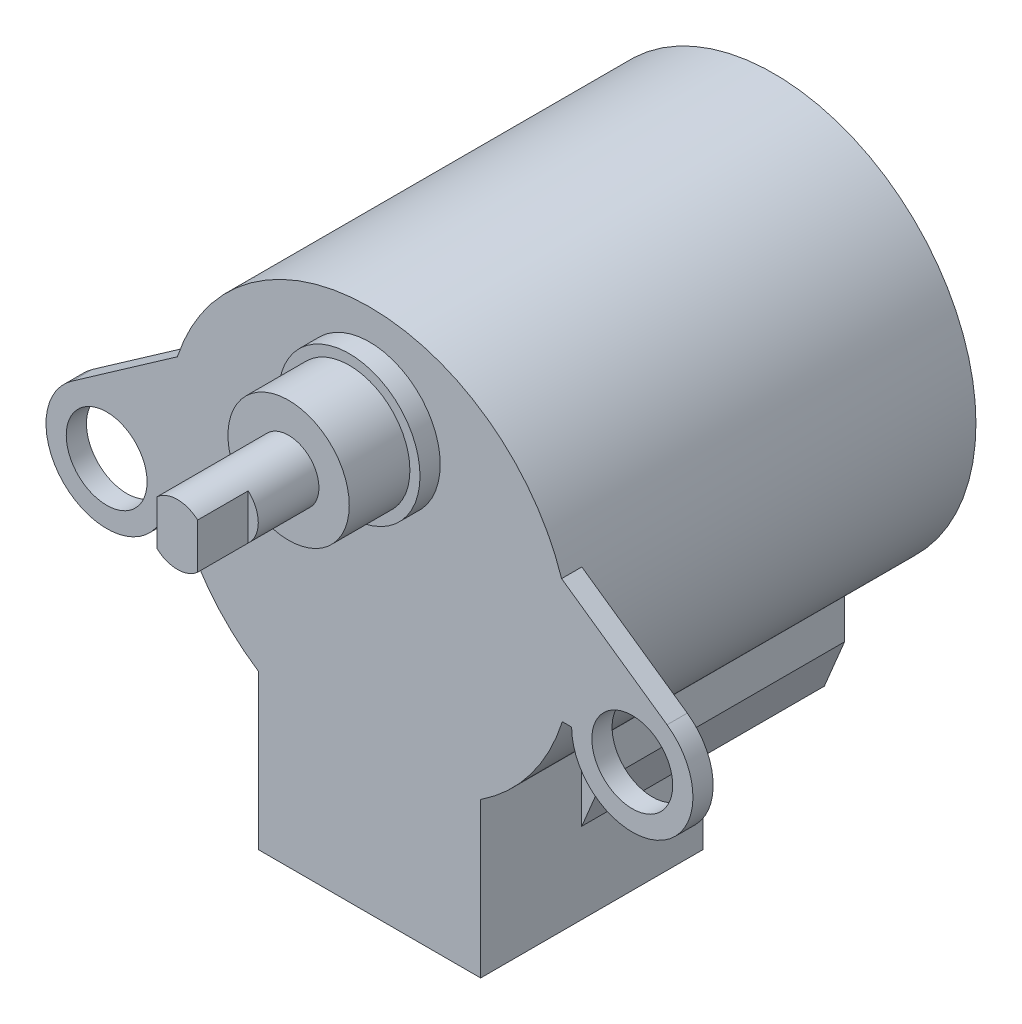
ISO-10303-21;
HEADER;
FILE_DESCRIPTION(('STEP AP214'),'2;1');
FILE_NAME('part.step','',(''),(''),'','','');
FILE_SCHEMA(('AUTOMOTIVE_DESIGN { 1 0 10303 214 1 1 1 1 }'));
ENDSEC;
DATA;
#1=APPLICATION_CONTEXT('core data for automotive mechanical design processes');
#2=APPLICATION_PROTOCOL_DEFINITION('international standard','automotive_design',2000,#1);
#3=PRODUCT_CONTEXT('',#1,'mechanical');
#4=PRODUCT('Part','Part','',(#3));
#5=PRODUCT_RELATED_PRODUCT_CATEGORY('part','',(#4));
#6=PRODUCT_DEFINITION_FORMATION('','',#4);
#7=PRODUCT_DEFINITION_CONTEXT('part definition',#1,'design');
#8=PRODUCT_DEFINITION('design','',#6,#7);
#9=PRODUCT_DEFINITION_SHAPE('','',#8);
#10=(LENGTH_UNIT() NAMED_UNIT(*) SI_UNIT(.MILLI.,.METRE.));
#11=(NAMED_UNIT(*) PLANE_ANGLE_UNIT() SI_UNIT($,.RADIAN.));
#12=(NAMED_UNIT(*) SI_UNIT($,.STERADIAN.) SOLID_ANGLE_UNIT());
#13=UNCERTAINTY_MEASURE_WITH_UNIT(LENGTH_MEASURE(1.E-05),#10,'distance_accuracy_value','');
#14=(GEOMETRIC_REPRESENTATION_CONTEXT(3) GLOBAL_UNCERTAINTY_ASSIGNED_CONTEXT((#13)) GLOBAL_UNIT_ASSIGNED_CONTEXT((#10,
#11,#12)) REPRESENTATION_CONTEXT('',''));
#15=CARTESIAN_POINT('',(0.,0.,0.));
#16=DIRECTION('',(0.,0.,1.));
#17=DIRECTION('',(1.,0.,0.));
#18=AXIS2_PLACEMENT_3D('',#15,#16,#17);
#19=CARTESIAN_POINT('',(0.,5.,4.));
#20=DIRECTION('',(0.,0.,1.));
#21=DIRECTION('',(1.,0.,0.));
#22=AXIS2_PLACEMENT_3D('',#19,#20,#21);
#23=PLANE('',#22);
#24=CARTESIAN_POINT('',(0.,5.,4.));
#25=DIRECTION('',(0.,0.,1.));
#26=DIRECTION('',(1.,0.,0.));
#27=AXIS2_PLACEMENT_3D('',#24,#25,#26);
#28=CIRCLE('',#27,3.);
#29=CARTESIAN_POINT('',(3.,5.,4.));
#30=VERTEX_POINT('',#29);
#31=EDGE_CURVE('E209',#30,#30,#28,.T.);
#32=ORIENTED_EDGE('',*,*,#31,.T.);
#33=EDGE_LOOP('',(#32));
#34=FACE_BOUND('',#33,.T.);
#35=CARTESIAN_POINT('',(0.,5.,4.));
#36=DIRECTION('',(0.,0.,1.));
#37=DIRECTION('',(1.,0.,0.));
#38=AXIS2_PLACEMENT_3D('',#35,#36,#37);
#39=CIRCLE('',#38,1.5);
#40=CARTESIAN_POINT('',(1.5,5.,4.));
#41=VERTEX_POINT('',#40);
#42=EDGE_CURVE('E211',#41,#41,#39,.T.);
#43=ORIENTED_EDGE('',*,*,#42,.F.);
#44=EDGE_LOOP('',(#43));
#45=FACE_BOUND('',#44,.T.);
#46=ADVANCED_FACE('F31',(#34,#45),#23,.T.);
#47=CARTESIAN_POINT('',(0.,5.,1.));
#48=DIRECTION('',(0.,0.,1.));
#49=DIRECTION('',(1.,0.,0.));
#50=AXIS2_PLACEMENT_3D('',#47,#48,#49);
#51=PLANE('',#50);
#52=CARTESIAN_POINT('',(0.,5.,1.));
#53=DIRECTION('',(0.,0.,1.));
#54=DIRECTION('',(1.,0.,0.));
#55=AXIS2_PLACEMENT_3D('',#52,#53,#54);
#56=CIRCLE('',#55,3.5);
#57=CARTESIAN_POINT('',(3.5,5.,1.));
#58=VERTEX_POINT('',#57);
#59=EDGE_CURVE('E220',#58,#58,#56,.T.);
#60=ORIENTED_EDGE('',*,*,#59,.T.);
#61=EDGE_LOOP('',(#60));
#62=FACE_BOUND('',#61,.T.);
#63=CARTESIAN_POINT('',(0.,5.,1.));
#64=DIRECTION('',(0.,0.,1.));
#65=DIRECTION('',(1.,0.,0.));
#66=AXIS2_PLACEMENT_3D('',#63,#64,#65);
#67=CIRCLE('',#66,3.);
#68=CARTESIAN_POINT('',(3.,5.,1.));
#69=VERTEX_POINT('',#68);
#70=EDGE_CURVE('E205',#69,#69,#67,.T.);
#71=ORIENTED_EDGE('',*,*,#70,.F.);
#72=EDGE_LOOP('',(#71));
#73=FACE_BOUND('',#72,.T.);
#74=ADVANCED_FACE('F483',(#62,#73),#51,.T.);
#75=CARTESIAN_POINT('',(0.,0.,0.));
#76=DIRECTION('',(0.,0.,1.));
#77=DIRECTION('',(1.,0.,0.));
#78=AXIS2_PLACEMENT_3D('',#75,#76,#77);
#79=PLANE('',#78);
#80=CARTESIAN_POINT('',(-13.,-3.,0.));
#81=DIRECTION('',(0.,0.,-1.));
#82=DIRECTION('',(-1.,0.,0.));
#83=AXIS2_PLACEMENT_3D('',#80,#81,#82);
#84=CIRCLE('',#83,2.);
#85=CARTESIAN_POINT('',(-15.,-3.,0.));
#86=VERTEX_POINT('',#85);
#87=EDGE_CURVE('E224',#86,#86,#84,.T.);
#88=ORIENTED_EDGE('',*,*,#87,.T.);
#89=EDGE_LOOP('',(#88));
#90=FACE_BOUND('',#89,.T.);
#91=CARTESIAN_POINT('',(13.,-3.,0.));
#92=DIRECTION('',(0.,0.,1.));
#93=DIRECTION('',(1.,0.,0.));
#94=AXIS2_PLACEMENT_3D('',#91,#92,#93);
#95=CIRCLE('',#94,2.);
#96=CARTESIAN_POINT('',(15.,-3.,0.));
#97=VERTEX_POINT('',#96);
#98=EDGE_CURVE('E249',#97,#97,#95,.T.);
#99=ORIENTED_EDGE('',*,*,#98,.F.);
#100=EDGE_LOOP('',(#99));
#101=FACE_BOUND('',#100,.T.);
#102=CARTESIAN_POINT('',(0.,0.,0.));
#103=DIRECTION('',(0.,0.,1.));
#104=DIRECTION('',(1.,0.,0.));
#105=AXIS2_PLACEMENT_3D('',#102,#103,#104);
#106=CIRCLE('',#105,10.);
#107=CARTESIAN_POINT('',(5.5,-8.35164654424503,0.));
#108=VERTEX_POINT('',#107);
#109=CARTESIAN_POINT('',(9.53939201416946,-3.,0.));
#110=VERTEX_POINT('',#109);
#111=EDGE_CURVE('E372',#108,#110,#106,.T.);
#112=ORIENTED_EDGE('',*,*,#111,.T.);
#113=DIRECTION('',(1.,0.,0.));
#114=VECTOR('',#113,1.);
#115=CARTESIAN_POINT('',(10.,-3.,0.));
#116=LINE('',#115,#114);
#117=CARTESIAN_POINT('',(10.,-3.,0.));
#118=VERTEX_POINT('',#117);
#119=EDGE_CURVE('E268',#110,#118,#116,.T.);
#120=ORIENTED_EDGE('',*,*,#119,.T.);
#121=CARTESIAN_POINT('',(13.,-3.,0.));
#122=DIRECTION('',(0.,0.,1.));
#123=DIRECTION('',(1.,0.,0.));
#124=AXIS2_PLACEMENT_3D('',#121,#122,#123);
#125=CIRCLE('',#124,3.);
#126=CARTESIAN_POINT('',(14.7207293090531,-0.542543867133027,0.));
#127=VERTEX_POINT('',#126);
#128=EDGE_CURVE('E263',#118,#127,#125,.T.);
#129=ORIENTED_EDGE('',*,*,#128,.T.);
#130=DIRECTION('',(-0.819152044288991,0.573576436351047,0.));
#131=VECTOR('',#130,1.);
#132=CARTESIAN_POINT('',(14.7207293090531,-0.542543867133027,0.));
#133=LINE('',#132,#131);
#134=CARTESIAN_POINT('',(9.50402273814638,3.11023339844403,0.));
#135=VERTEX_POINT('',#134);
#136=EDGE_CURVE('E266',#127,#135,#133,.T.);
#137=ORIENTED_EDGE('',*,*,#136,.T.);
#138=CARTESIAN_POINT('',(-9.50402273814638,3.11023339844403,0.));
#139=VERTEX_POINT('',#138);
#140=EDGE_CURVE('E376',#135,#139,#106,.T.);
#141=ORIENTED_EDGE('',*,*,#140,.T.);
#142=DIRECTION('',(0.819152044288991,0.573576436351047,0.));
#143=VECTOR('',#142,1.);
#144=CARTESIAN_POINT('',(-14.7207293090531,-0.542543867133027,0.));
#145=LINE('',#144,#143);
#146=CARTESIAN_POINT('',(-14.7207293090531,-0.542543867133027,0.));
#147=VERTEX_POINT('',#146);
#148=EDGE_CURVE('E234',#147,#139,#145,.T.);
#149=ORIENTED_EDGE('',*,*,#148,.F.);
#150=CARTESIAN_POINT('',(-13.,-3.,0.));
#151=DIRECTION('',(0.,0.,-1.));
#152=DIRECTION('',(-1.,0.,0.));
#153=AXIS2_PLACEMENT_3D('',#150,#151,#152);
#154=CIRCLE('',#153,3.);
#155=CARTESIAN_POINT('',(-10.,-3.,0.));
#156=VERTEX_POINT('',#155);
#157=EDGE_CURVE('E227',#156,#147,#154,.T.);
#158=ORIENTED_EDGE('',*,*,#157,.F.);
#159=DIRECTION('',(-1.,0.,0.));
#160=VECTOR('',#159,1.);
#161=CARTESIAN_POINT('',(-10.,-3.,0.));
#162=LINE('',#161,#160);
#163=CARTESIAN_POINT('',(-9.53939201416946,-3.,0.));
#164=VERTEX_POINT('',#163);
#165=EDGE_CURVE('E232',#164,#156,#162,.T.);
#166=ORIENTED_EDGE('',*,*,#165,.F.);
#167=CARTESIAN_POINT('',(-5.5,-8.35164654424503,0.));
#168=VERTEX_POINT('',#167);
#169=EDGE_CURVE('E365',#164,#168,#106,.T.);
#170=ORIENTED_EDGE('',*,*,#169,.T.);
#171=DIRECTION('',(0.,-1.,0.));
#172=VECTOR('',#171,1.);
#173=CARTESIAN_POINT('',(-5.5,-8.35164654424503,0.));
#174=LINE('',#173,#172);
#175=CARTESIAN_POINT('',(-5.5,-16.,0.));
#176=VERTEX_POINT('',#175);
#177=EDGE_CURVE('E348',#168,#176,#174,.T.);
#178=ORIENTED_EDGE('',*,*,#177,.T.);
#179=DIRECTION('',(1.,0.,0.));
#180=VECTOR('',#179,1.);
#181=CARTESIAN_POINT('',(-5.5,-16.,0.));
#182=LINE('',#181,#180);
#183=CARTESIAN_POINT('',(5.5,-16.,0.));
#184=VERTEX_POINT('',#183);
#185=EDGE_CURVE('E351',#176,#184,#182,.T.);
#186=ORIENTED_EDGE('',*,*,#185,.T.);
#187=DIRECTION('',(0.,1.,0.));
#188=VECTOR('',#187,1.);
#189=CARTESIAN_POINT('',(5.5,-8.35164654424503,0.));
#190=LINE('',#189,#188);
#191=EDGE_CURVE('E345',#184,#108,#190,.T.);
#192=ORIENTED_EDGE('',*,*,#191,.T.);
#193=EDGE_LOOP('',(#112,#120,#129,#137,#141,#149,#158,#166,#170,#178,#186,#192));
#194=FACE_BOUND('',#193,.T.);
#195=CARTESIAN_POINT('',(0.,5.,0.));
#196=DIRECTION('',(0.,0.,1.));
#197=DIRECTION('',(1.,0.,0.));
#198=AXIS2_PLACEMENT_3D('',#195,#196,#197);
#199=CIRCLE('',#198,3.5);
#200=CARTESIAN_POINT('',(3.5,5.,0.));
#201=VERTEX_POINT('',#200);
#202=EDGE_CURVE('E217',#201,#201,#199,.T.);
#203=ORIENTED_EDGE('',*,*,#202,.F.);
#204=EDGE_LOOP('',(#203));
#205=FACE_BOUND('',#204,.T.);
#206=ADVANCED_FACE('F400',(#90,#101,#194,#205),#79,.T.);
#207=CARTESIAN_POINT('',(-13.,-3.,-1.));
#208=DIRECTION('',(0.,0.,1.));
#209=DIRECTION('',(-1.,0.,0.));
#210=AXIS2_PLACEMENT_3D('',#207,#208,#209);
#211=PLANE('',#210);
#212=CARTESIAN_POINT('',(-13.,-3.,-1.));
#213=DIRECTION('',(0.,0.,-1.));
#214=DIRECTION('',(-1.,0.,0.));
#215=AXIS2_PLACEMENT_3D('',#212,#213,#214);
#216=CIRCLE('',#215,3.);
#217=CARTESIAN_POINT('',(-10.,-3.,-1.));
#218=VERTEX_POINT('',#217);
#219=CARTESIAN_POINT('',(-14.7207293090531,-0.542543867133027,-1.));
#220=VERTEX_POINT('',#219);
#221=EDGE_CURVE('E236',#218,#220,#216,.T.);
#222=ORIENTED_EDGE('',*,*,#221,.T.);
#223=DIRECTION('',(0.819152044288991,0.573576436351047,0.));
#224=VECTOR('',#223,1.);
#225=CARTESIAN_POINT('',(-14.7207293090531,-0.542543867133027,-1.));
#226=LINE('',#225,#224);
#227=CARTESIAN_POINT('',(-9.50402273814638,3.11023339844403,-1.));
#228=VERTEX_POINT('',#227);
#229=EDGE_CURVE('E243',#220,#228,#226,.T.);
#230=ORIENTED_EDGE('',*,*,#229,.T.);
#231=CARTESIAN_POINT('',(0.,0.,-1.));
#232=DIRECTION('',(0.,0.,1.));
#233=DIRECTION('',(-1.,0.,0.));
#234=AXIS2_PLACEMENT_3D('',#231,#232,#233);
#235=CIRCLE('',#234,10.);
#236=CARTESIAN_POINT('',(-9.53939201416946,-3.,-1.));
#237=VERTEX_POINT('',#236);
#238=EDGE_CURVE('E241',#228,#237,#235,.T.);
#239=ORIENTED_EDGE('',*,*,#238,.T.);
#240=DIRECTION('',(-1.,0.,0.));
#241=VECTOR('',#240,1.);
#242=CARTESIAN_POINT('',(-10.,-3.,-1.));
#243=LINE('',#242,#241);
#244=EDGE_CURVE('E239',#237,#218,#243,.T.);
#245=ORIENTED_EDGE('',*,*,#244,.T.);
#246=EDGE_LOOP('',(#222,#230,#239,#245));
#247=FACE_BOUND('',#246,.T.);
#248=CARTESIAN_POINT('',(-13.,-3.,-1.));
#249=DIRECTION('',(0.,0.,1.));
#250=DIRECTION('',(1.,0.,0.));
#251=AXIS2_PLACEMENT_3D('',#248,#249,#250);
#252=CIRCLE('',#251,2.);
#253=CARTESIAN_POINT('',(-11.,-3.,-1.));
#254=VERTEX_POINT('',#253);
#255=EDGE_CURVE('E223',#254,#254,#252,.T.);
#256=ORIENTED_EDGE('',*,*,#255,.T.);
#257=EDGE_LOOP('',(#256));
#258=FACE_BOUND('',#257,.T.);
#259=ADVANCED_FACE('F462',(#247,#258),#211,.F.);
#260=CARTESIAN_POINT('',(0.,0.,-20.));
#261=DIRECTION('',(0.,0.,1.));
#262=DIRECTION('',(1.,0.,0.));
#263=AXIS2_PLACEMENT_3D('',#260,#261,#262);
#264=CYLINDRICAL_SURFACE('',#263,10.);
#265=CARTESIAN_POINT('',(0.,0.,-20.));
#266=DIRECTION('',(0.,0.,1.));
#267=DIRECTION('',(1.,0.,0.));
#268=AXIS2_PLACEMENT_3D('',#265,#266,#267);
#269=CIRCLE('',#268,10.);
#270=CARTESIAN_POINT('',(10.,0.,-20.));
#271=VERTEX_POINT('',#270);
#272=EDGE_CURVE('E375',#271,#271,#269,.T.);
#273=ORIENTED_EDGE('',*,*,#272,.T.);
#274=EDGE_LOOP('',(#273));
#275=FACE_BOUND('',#274,.T.);
#276=ORIENTED_EDGE('',*,*,#238,.F.);
#277=DIRECTION('',(0.,0.,1.));
#278=VECTOR('',#277,1.);
#279=CARTESIAN_POINT('',(-9.50402273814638,3.11023339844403,-1.));
#280=LINE('',#279,#278);
#281=EDGE_CURVE('E250',#228,#139,#280,.T.);
#282=ORIENTED_EDGE('',*,*,#281,.T.);
#283=ORIENTED_EDGE('',*,*,#140,.F.);
#284=DIRECTION('',(0.,0.,1.));
#285=VECTOR('',#284,1.);
#286=CARTESIAN_POINT('',(9.50402273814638,3.11023339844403,-1.));
#287=LINE('',#286,#285);
#288=CARTESIAN_POINT('',(9.50402273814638,3.11023339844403,-1.));
#289=VERTEX_POINT('',#288);
#290=EDGE_CURVE('E290',#289,#135,#287,.T.);
#291=ORIENTED_EDGE('',*,*,#290,.F.);
#292=CARTESIAN_POINT('',(0.,0.,-1.));
#293=DIRECTION('',(0.,0.,-1.));
#294=DIRECTION('',(1.,0.,0.));
#295=AXIS2_PLACEMENT_3D('',#292,#293,#294);
#296=CIRCLE('',#295,10.);
#297=CARTESIAN_POINT('',(9.53939201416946,-3.,-1.));
#298=VERTEX_POINT('',#297);
#299=EDGE_CURVE('E277',#289,#298,#296,.T.);
#300=ORIENTED_EDGE('',*,*,#299,.T.);
#301=DIRECTION('',(0.,0.,1.));
#302=VECTOR('',#301,1.);
#303=CARTESIAN_POINT('',(9.53939201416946,-3.,-1.));
#304=LINE('',#303,#302);
#305=EDGE_CURVE('E287',#298,#110,#304,.T.);
#306=ORIENTED_EDGE('',*,*,#305,.T.);
#307=ORIENTED_EDGE('',*,*,#111,.F.);
#308=DIRECTION('',(0.,0.,1.));
#309=VECTOR('',#308,1.);
#310=CARTESIAN_POINT('',(5.5,-8.35164654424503,-11.));
#311=LINE('',#310,#309);
#312=CARTESIAN_POINT('',(5.5,-8.35164654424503,-5.));
#313=VERTEX_POINT('',#312);
#314=EDGE_CURVE('E362',#313,#108,#311,.T.);
#315=ORIENTED_EDGE('',*,*,#314,.F.);
#316=CARTESIAN_POINT('',(0.,0.,-5.));
#317=DIRECTION('',(0.,0.,1.));
#318=DIRECTION('',(-1.,0.,0.));
#319=AXIS2_PLACEMENT_3D('',#316,#317,#318);
#320=CIRCLE('',#319,10.);
#321=CARTESIAN_POINT('',(6.5,-7.59934207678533,-5.));
#322=VERTEX_POINT('',#321);
#323=EDGE_CURVE('E322',#313,#322,#320,.T.);
#324=ORIENTED_EDGE('',*,*,#323,.T.);
#325=DIRECTION('',(0.,0.,-1.));
#326=VECTOR('',#325,1.);
#327=CARTESIAN_POINT('',(6.5,-7.59934207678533,-5.));
#328=LINE('',#327,#326);
#329=CARTESIAN_POINT('',(6.5,-7.59934207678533,-17.));
#330=VERTEX_POINT('',#329);
#331=EDGE_CURVE('E327',#322,#330,#328,.T.);
#332=ORIENTED_EDGE('',*,*,#331,.T.);
#333=CARTESIAN_POINT('',(0.,0.,-17.));
#334=DIRECTION('',(0.,0.,1.));
#335=DIRECTION('',(-1.,0.,0.));
#336=AXIS2_PLACEMENT_3D('',#333,#334,#335);
#337=CIRCLE('',#336,10.);
#338=CARTESIAN_POINT('',(-6.5,-7.59934207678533,-17.));
#339=VERTEX_POINT('',#338);
#340=EDGE_CURVE('E308',#339,#330,#337,.T.);
#341=ORIENTED_EDGE('',*,*,#340,.F.);
#342=DIRECTION('',(0.,0.,-1.));
#343=VECTOR('',#342,1.);
#344=CARTESIAN_POINT('',(-6.5,-7.59934207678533,-5.));
#345=LINE('',#344,#343);
#346=CARTESIAN_POINT('',(-6.5,-7.59934207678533,-5.));
#347=VERTEX_POINT('',#346);
#348=EDGE_CURVE('E331',#347,#339,#345,.T.);
#349=ORIENTED_EDGE('',*,*,#348,.F.);
#350=CARTESIAN_POINT('',(-5.5,-8.35164654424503,-5.));
#351=VERTEX_POINT('',#350);
#352=EDGE_CURVE('E323',#347,#351,#320,.T.);
#353=ORIENTED_EDGE('',*,*,#352,.T.);
#354=DIRECTION('',(0.,0.,1.));
#355=VECTOR('',#354,1.);
#356=CARTESIAN_POINT('',(-5.5,-8.35164654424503,-11.));
#357=LINE('',#356,#355);
#358=EDGE_CURVE('E368',#351,#168,#357,.T.);
#359=ORIENTED_EDGE('',*,*,#358,.T.);
#360=ORIENTED_EDGE('',*,*,#169,.F.);
#361=DIRECTION('',(0.,0.,1.));
#362=VECTOR('',#361,1.);
#363=CARTESIAN_POINT('',(-9.53939201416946,-3.,-1.));
#364=LINE('',#363,#362);
#365=EDGE_CURVE('E253',#237,#164,#364,.T.);
#366=ORIENTED_EDGE('',*,*,#365,.F.);
#367=EDGE_LOOP('',(#276,#282,#283,#291,#300,#306,#307,#315,#324,#332,#341,#349,#353,#359,#360,#366));
#368=FACE_BOUND('',#367,.T.);
#369=ADVANCED_FACE('F33',(#275,#368),#264,.T.);
#370=CARTESIAN_POINT('',(0.,0.,-20.));
#371=DIRECTION('',(0.,0.,1.));
#372=DIRECTION('',(1.,0.,0.));
#373=AXIS2_PLACEMENT_3D('',#370,#371,#372);
#374=PLANE('',#373);
#375=ORIENTED_EDGE('',*,*,#272,.F.);
#376=EDGE_LOOP('',(#375));
#377=FACE_BOUND('',#376,.T.);
#378=ADVANCED_FACE('F629',(#377),#374,.F.);
#379=CARTESIAN_POINT('',(5.5,-8.35164654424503,-11.));
#380=DIRECTION('',(1.,0.,0.));
#381=DIRECTION('',(0.,1.,0.));
#382=AXIS2_PLACEMENT_3D('',#379,#380,#381);
#383=PLANE('',#382);
#384=DIRECTION('',(0.,0.,-1.));
#385=VECTOR('',#384,1.);
#386=CARTESIAN_POINT('',(5.5,-12.,-5.));
#387=LINE('',#386,#385);
#388=CARTESIAN_POINT('',(5.5,-12.,-5.));
#389=VERTEX_POINT('',#388);
#390=CARTESIAN_POINT('',(5.5,-12.,-11.));
#391=VERTEX_POINT('',#390);
#392=EDGE_CURVE('E339',#389,#391,#387,.T.);
#393=ORIENTED_EDGE('',*,*,#392,.F.);
#394=DIRECTION('',(0.,1.,0.));
#395=VECTOR('',#394,1.);
#396=CARTESIAN_POINT('',(5.5,-8.35164654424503,-5.));
#397=LINE('',#396,#395);
#398=EDGE_CURVE('E330',#389,#313,#397,.T.);
#399=ORIENTED_EDGE('',*,*,#398,.T.);
#400=ORIENTED_EDGE('',*,*,#314,.T.);
#401=ORIENTED_EDGE('',*,*,#191,.F.);
#402=DIRECTION('',(0.,0.,1.));
#403=VECTOR('',#402,1.);
#404=CARTESIAN_POINT('',(5.5,-16.,-11.));
#405=LINE('',#404,#403);
#406=CARTESIAN_POINT('',(5.5,-16.,-11.));
#407=VERTEX_POINT('',#406);
#408=EDGE_CURVE('E363',#407,#184,#405,.T.);
#409=ORIENTED_EDGE('',*,*,#408,.F.);
#410=DIRECTION('',(0.,1.,0.));
#411=VECTOR('',#410,1.);
#412=CARTESIAN_POINT('',(5.5,-8.35164654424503,-11.));
#413=LINE('',#412,#411);
#414=EDGE_CURVE('E354',#407,#391,#413,.T.);
#415=ORIENTED_EDGE('',*,*,#414,.T.);
#416=EDGE_LOOP('',(#393,#399,#400,#401,#409,#415));
#417=FACE_BOUND('',#416,.T.);
#418=ADVANCED_FACE('F389',(#417),#383,.T.);
#419=CARTESIAN_POINT('',(-5.5,-16.,-11.));
#420=DIRECTION('',(0.,-1.,0.));
#421=DIRECTION('',(0.,0.,-1.));
#422=AXIS2_PLACEMENT_3D('',#419,#420,#421);
#423=PLANE('',#422);
#424=ORIENTED_EDGE('',*,*,#185,.F.);
#425=DIRECTION('',(0.,0.,1.));
#426=VECTOR('',#425,1.);
#427=CARTESIAN_POINT('',(-5.5,-16.,-11.));
#428=LINE('',#427,#426);
#429=CARTESIAN_POINT('',(-5.5,-16.,-11.));
#430=VERTEX_POINT('',#429);
#431=EDGE_CURVE('E366',#430,#176,#428,.T.);
#432=ORIENTED_EDGE('',*,*,#431,.F.);
#433=DIRECTION('',(1.,0.,0.));
#434=VECTOR('',#433,1.);
#435=CARTESIAN_POINT('',(-5.5,-16.,-11.));
#436=LINE('',#435,#434);
#437=EDGE_CURVE('E359',#430,#407,#436,.T.);
#438=ORIENTED_EDGE('',*,*,#437,.T.);
#439=ORIENTED_EDGE('',*,*,#408,.T.);
#440=EDGE_LOOP('',(#424,#432,#438,#439));
#441=FACE_BOUND('',#440,.T.);
#442=ADVANCED_FACE('F393',(#441),#423,.T.);
#443=CARTESIAN_POINT('',(-5.5,-8.35164654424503,-11.));
#444=DIRECTION('',(-1.,0.,0.));
#445=DIRECTION('',(0.,-1.,0.));
#446=AXIS2_PLACEMENT_3D('',#443,#444,#445);
#447=PLANE('',#446);
#448=DIRECTION('',(0.,0.,-1.));
#449=VECTOR('',#448,1.);
#450=CARTESIAN_POINT('',(-5.5,-12.,-5.));
#451=LINE('',#450,#449);
#452=CARTESIAN_POINT('',(-5.5,-12.,-5.));
#453=VERTEX_POINT('',#452);
#454=CARTESIAN_POINT('',(-5.5,-12.,-11.));
#455=VERTEX_POINT('',#454);
#456=EDGE_CURVE('E335',#453,#455,#451,.T.);
#457=ORIENTED_EDGE('',*,*,#456,.T.);
#458=DIRECTION('',(0.,-1.,0.));
#459=VECTOR('',#458,1.);
#460=CARTESIAN_POINT('',(-5.5,-8.35164654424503,-11.));
#461=LINE('',#460,#459);
#462=EDGE_CURVE('E357',#455,#430,#461,.T.);
#463=ORIENTED_EDGE('',*,*,#462,.T.);
#464=ORIENTED_EDGE('',*,*,#431,.T.);
#465=ORIENTED_EDGE('',*,*,#177,.F.);
#466=ORIENTED_EDGE('',*,*,#358,.F.);
#467=DIRECTION('',(0.,-1.,0.));
#468=VECTOR('',#467,1.);
#469=CARTESIAN_POINT('',(-5.5,-8.35164654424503,-5.));
#470=LINE('',#469,#468);
#471=EDGE_CURVE('E11',#351,#453,#470,.T.);
#472=ORIENTED_EDGE('',*,*,#471,.T.);
#473=EDGE_LOOP('',(#457,#463,#464,#465,#466,#472));
#474=FACE_BOUND('',#473,.T.);
#475=ADVANCED_FACE('F397',(#474),#447,.T.);
#476=CARTESIAN_POINT('',(0.,0.,-11.));
#477=DIRECTION('',(0.,0.,1.));
#478=DIRECTION('',(1.,0.,0.));
#479=AXIS2_PLACEMENT_3D('',#476,#477,#478);
#480=PLANE('',#479);
#481=ORIENTED_EDGE('',*,*,#462,.F.);
#482=DIRECTION('',(1.,0.,0.));
#483=VECTOR('',#482,1.);
#484=CARTESIAN_POINT('',(0.,-12.,-11.));
#485=LINE('',#484,#483);
#486=EDGE_CURVE('E39',#455,#391,#485,.T.);
#487=ORIENTED_EDGE('',*,*,#486,.T.);
#488=ORIENTED_EDGE('',*,*,#414,.F.);
#489=ORIENTED_EDGE('',*,*,#437,.F.);
#490=EDGE_LOOP('',(#481,#487,#488,#489));
#491=FACE_BOUND('',#490,.T.);
#492=ADVANCED_FACE('F382',(#491),#480,.F.);
#493=CARTESIAN_POINT('',(0.,0.,-5.));
#494=DIRECTION('',(0.,0.,-1.));
#495=DIRECTION('',(-1.,0.,0.));
#496=AXIS2_PLACEMENT_3D('',#493,#494,#495);
#497=PLANE('',#496);
#498=ORIENTED_EDGE('',*,*,#398,.F.);
#499=DIRECTION('',(-0.384525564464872,-0.923114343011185,0.));
#500=VECTOR('',#499,1.);
#501=CARTESIAN_POINT('',(6.5,-9.59934207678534,-5.));
#502=LINE('',#501,#500);
#503=CARTESIAN_POINT('',(6.5,-9.59934207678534,-5.));
#504=VERTEX_POINT('',#503);
#505=EDGE_CURVE('E314',#504,#389,#502,.T.);
#506=ORIENTED_EDGE('',*,*,#505,.F.);
#507=DIRECTION('',(0.,-1.,0.));
#508=VECTOR('',#507,1.);
#509=CARTESIAN_POINT('',(6.5,-9.59934207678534,-5.));
#510=LINE('',#509,#508);
#511=EDGE_CURVE('E311',#322,#504,#510,.T.);
#512=ORIENTED_EDGE('',*,*,#511,.F.);
#513=ORIENTED_EDGE('',*,*,#323,.F.);
#514=EDGE_LOOP('',(#498,#506,#512,#513));
#515=FACE_BOUND('',#514,.T.);
#516=ADVANCED_FACE('F427',(#515),#497,.F.);
#517=CARTESIAN_POINT('',(5.5,-12.,-5.));
#518=DIRECTION('',(0.,-1.,0.));
#519=DIRECTION('',(1.,0.,0.));
#520=AXIS2_PLACEMENT_3D('',#517,#518,#519);
#521=PLANE('',#520);
#522=ORIENTED_EDGE('',*,*,#486,.F.);
#523=CARTESIAN_POINT('',(-5.5,-12.,-17.));
#524=VERTEX_POINT('',#523);
#525=EDGE_CURVE('E338',#455,#524,#451,.T.);
#526=ORIENTED_EDGE('',*,*,#525,.T.);
#527=DIRECTION('',(-1.,0.,0.));
#528=VECTOR('',#527,1.);
#529=CARTESIAN_POINT('',(5.5,-12.,-17.));
#530=LINE('',#529,#528);
#531=CARTESIAN_POINT('',(5.5,-12.,-17.));
#532=VERTEX_POINT('',#531);
#533=EDGE_CURVE('E299',#532,#524,#530,.T.);
#534=ORIENTED_EDGE('',*,*,#533,.F.);
#535=EDGE_CURVE('E341',#391,#532,#387,.T.);
#536=ORIENTED_EDGE('',*,*,#535,.F.);
#537=EDGE_LOOP('',(#522,#526,#534,#536));
#538=FACE_BOUND('',#537,.T.);
#539=ADVANCED_FACE('F418',(#538),#521,.T.);
#540=CARTESIAN_POINT('',(6.5,-9.59934207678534,-5.));
#541=DIRECTION('',(1.,0.,0.));
#542=DIRECTION('',(0.,0.,-1.));
#543=AXIS2_PLACEMENT_3D('',#540,#541,#542);
#544=PLANE('',#543);
#545=DIRECTION('',(0.,-1.,0.));
#546=VECTOR('',#545,1.);
#547=CARTESIAN_POINT('',(6.5,-9.59934207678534,-17.));
#548=LINE('',#547,#546);
#549=CARTESIAN_POINT('',(6.5,-9.59934207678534,-17.));
#550=VERTEX_POINT('',#549);
#551=EDGE_CURVE('E286',#330,#550,#548,.T.);
#552=ORIENTED_EDGE('',*,*,#551,.F.);
#553=ORIENTED_EDGE('',*,*,#331,.F.);
#554=ORIENTED_EDGE('',*,*,#511,.T.);
#555=DIRECTION('',(0.,0.,-1.));
#556=VECTOR('',#555,1.);
#557=CARTESIAN_POINT('',(6.5,-9.59934207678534,-5.));
#558=LINE('',#557,#556);
#559=EDGE_CURVE('E326',#504,#550,#558,.T.);
#560=ORIENTED_EDGE('',*,*,#559,.T.);
#561=EDGE_LOOP('',(#552,#553,#554,#560));
#562=FACE_BOUND('',#561,.T.);
#563=ADVANCED_FACE('F430',(#562),#544,.T.);
#564=CARTESIAN_POINT('',(-6.5,-9.59934207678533,-5.));
#565=DIRECTION('',(-1.,0.,0.));
#566=DIRECTION('',(0.,-1.,0.));
#567=AXIS2_PLACEMENT_3D('',#564,#565,#566);
#568=PLANE('',#567);
#569=DIRECTION('',(0.,1.,0.));
#570=VECTOR('',#569,1.);
#571=CARTESIAN_POINT('',(-6.5,-9.59934207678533,-17.));
#572=LINE('',#571,#570);
#573=CARTESIAN_POINT('',(-6.5,-9.59934207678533,-17.));
#574=VERTEX_POINT('',#573);
#575=EDGE_CURVE('E305',#574,#339,#572,.T.);
#576=ORIENTED_EDGE('',*,*,#575,.F.);
#577=DIRECTION('',(0.,0.,-1.));
#578=VECTOR('',#577,1.);
#579=CARTESIAN_POINT('',(-6.5,-9.59934207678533,-5.));
#580=LINE('',#579,#578);
#581=CARTESIAN_POINT('',(-6.5,-9.59934207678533,-5.));
#582=VERTEX_POINT('',#581);
#583=EDGE_CURVE('E333',#582,#574,#580,.T.);
#584=ORIENTED_EDGE('',*,*,#583,.F.);
#585=DIRECTION('',(0.,1.,0.));
#586=VECTOR('',#585,1.);
#587=CARTESIAN_POINT('',(-6.5,-9.59934207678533,-5.));
#588=LINE('',#587,#586);
#589=EDGE_CURVE('E320',#582,#347,#588,.T.);
#590=ORIENTED_EDGE('',*,*,#589,.T.);
#591=ORIENTED_EDGE('',*,*,#348,.T.);
#592=EDGE_LOOP('',(#576,#584,#590,#591));
#593=FACE_BOUND('',#592,.T.);
#594=ADVANCED_FACE('F709',(#593),#568,.T.);
#595=CARTESIAN_POINT('',(-6.5,-9.59934207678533,-5.));
#596=DIRECTION('',(-0.923114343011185,-0.384525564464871,0.));
#597=DIRECTION('',(0.384525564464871,-0.923114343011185,0.));
#598=AXIS2_PLACEMENT_3D('',#595,#596,#597);
#599=PLANE('',#598);
#600=DIRECTION('',(-0.384525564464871,0.923114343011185,0.));
#601=VECTOR('',#600,1.);
#602=CARTESIAN_POINT('',(-6.5,-9.59934207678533,-17.));
#603=LINE('',#602,#601);
#604=EDGE_CURVE('E302',#524,#574,#603,.T.);
#605=ORIENTED_EDGE('',*,*,#604,.F.);
#606=ORIENTED_EDGE('',*,*,#525,.F.);
#607=ORIENTED_EDGE('',*,*,#456,.F.);
#608=DIRECTION('',(-0.384525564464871,0.923114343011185,0.));
#609=VECTOR('',#608,1.);
#610=CARTESIAN_POINT('',(-6.5,-9.59934207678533,-5.));
#611=LINE('',#610,#609);
#612=EDGE_CURVE('E317',#453,#582,#611,.T.);
#613=ORIENTED_EDGE('',*,*,#612,.T.);
#614=ORIENTED_EDGE('',*,*,#583,.T.);
#615=EDGE_LOOP('',(#605,#606,#607,#613,#614));
#616=FACE_BOUND('',#615,.T.);
#617=ADVANCED_FACE('F415',(#616),#599,.T.);
#618=CARTESIAN_POINT('',(6.5,-9.59934207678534,-5.));
#619=DIRECTION('',(0.923114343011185,-0.384525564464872,0.));
#620=DIRECTION('',(0.384525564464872,0.923114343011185,0.));
#621=AXIS2_PLACEMENT_3D('',#618,#619,#620);
#622=PLANE('',#621);
#623=DIRECTION('',(-0.384525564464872,-0.923114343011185,0.));
#624=VECTOR('',#623,1.);
#625=CARTESIAN_POINT('',(6.5,-9.59934207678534,-17.));
#626=LINE('',#625,#624);
#627=EDGE_CURVE('E296',#550,#532,#626,.T.);
#628=ORIENTED_EDGE('',*,*,#627,.F.);
#629=ORIENTED_EDGE('',*,*,#559,.F.);
#630=ORIENTED_EDGE('',*,*,#505,.T.);
#631=ORIENTED_EDGE('',*,*,#392,.T.);
#632=ORIENTED_EDGE('',*,*,#535,.T.);
#633=EDGE_LOOP('',(#628,#629,#630,#631,#632));
#634=FACE_BOUND('',#633,.T.);
#635=ADVANCED_FACE('F423',(#634),#622,.T.);
#636=ORIENTED_EDGE('',*,*,#471,.F.);
#637=ORIENTED_EDGE('',*,*,#352,.F.);
#638=ORIENTED_EDGE('',*,*,#589,.F.);
#639=ORIENTED_EDGE('',*,*,#612,.F.);
#640=EDGE_LOOP('',(#636,#637,#638,#639));
#641=FACE_BOUND('',#640,.T.);
#642=ADVANCED_FACE('F411',(#641),#497,.F.);
#643=CARTESIAN_POINT('',(0.,0.,-17.));
#644=DIRECTION('',(0.,0.,-1.));
#645=DIRECTION('',(-1.,0.,0.));
#646=AXIS2_PLACEMENT_3D('',#643,#644,#645);
#647=PLANE('',#646);
#648=ORIENTED_EDGE('',*,*,#551,.T.);
#649=ORIENTED_EDGE('',*,*,#627,.T.);
#650=ORIENTED_EDGE('',*,*,#533,.T.);
#651=ORIENTED_EDGE('',*,*,#604,.T.);
#652=ORIENTED_EDGE('',*,*,#575,.T.);
#653=ORIENTED_EDGE('',*,*,#340,.T.);
#654=EDGE_LOOP('',(#648,#649,#650,#651,#652,#653));
#655=FACE_BOUND('',#654,.T.);
#656=ADVANCED_FACE('F421',(#655),#647,.T.);
#657=CARTESIAN_POINT('',(13.,-3.,-1.));
#658=DIRECTION('',(0.,0.,1.));
#659=DIRECTION('',(1.,0.,0.));
#660=AXIS2_PLACEMENT_3D('',#657,#658,#659);
#661=CYLINDRICAL_SURFACE('',#660,3.);
#662=ORIENTED_EDGE('',*,*,#128,.F.);
#663=DIRECTION('',(0.,0.,1.));
#664=VECTOR('',#663,1.);
#665=CARTESIAN_POINT('',(10.,-3.,-1.));
#666=LINE('',#665,#664);
#667=CARTESIAN_POINT('',(10.,-3.,-1.));
#668=VERTEX_POINT('',#667);
#669=EDGE_CURVE('E284',#668,#118,#666,.T.);
#670=ORIENTED_EDGE('',*,*,#669,.F.);
#671=CARTESIAN_POINT('',(13.,-3.,-1.));
#672=DIRECTION('',(0.,0.,1.));
#673=DIRECTION('',(1.,0.,0.));
#674=AXIS2_PLACEMENT_3D('',#671,#672,#673);
#675=CIRCLE('',#674,3.);
#676=CARTESIAN_POINT('',(14.7207293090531,-0.542543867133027,-1.));
#677=VERTEX_POINT('',#676);
#678=EDGE_CURVE('E271',#668,#677,#675,.T.);
#679=ORIENTED_EDGE('',*,*,#678,.T.);
#680=DIRECTION('',(0.,0.,1.));
#681=VECTOR('',#680,1.);
#682=CARTESIAN_POINT('',(14.7207293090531,-0.542543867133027,-1.));
#683=LINE('',#682,#681);
#684=EDGE_CURVE('E283',#677,#127,#683,.T.);
#685=ORIENTED_EDGE('',*,*,#684,.T.);
#686=EDGE_LOOP('',(#662,#670,#679,#685));
#687=FACE_BOUND('',#686,.T.);
#688=ADVANCED_FACE('F444',(#687),#661,.T.);
#689=CARTESIAN_POINT('',(10.,-3.,-1.));
#690=DIRECTION('',(0.,-1.,0.));
#691=DIRECTION('',(0.,0.,-1.));
#692=AXIS2_PLACEMENT_3D('',#689,#690,#691);
#693=PLANE('',#692);
#694=ORIENTED_EDGE('',*,*,#119,.F.);
#695=ORIENTED_EDGE('',*,*,#305,.F.);
#696=DIRECTION('',(1.,0.,0.));
#697=VECTOR('',#696,1.);
#698=CARTESIAN_POINT('',(10.,-3.,-1.));
#699=LINE('',#698,#697);
#700=EDGE_CURVE('E280',#298,#668,#699,.T.);
#701=ORIENTED_EDGE('',*,*,#700,.T.);
#702=ORIENTED_EDGE('',*,*,#669,.T.);
#703=EDGE_LOOP('',(#694,#695,#701,#702));
#704=FACE_BOUND('',#703,.T.);
#705=ADVANCED_FACE('F437',(#704),#693,.T.);
#706=CARTESIAN_POINT('',(14.7207293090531,-0.542543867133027,-1.));
#707=DIRECTION('',(0.573576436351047,0.819152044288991,0.));
#708=DIRECTION('',(-0.819152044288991,0.573576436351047,0.));
#709=AXIS2_PLACEMENT_3D('',#706,#707,#708);
#710=PLANE('',#709);
#711=ORIENTED_EDGE('',*,*,#136,.F.);
#712=ORIENTED_EDGE('',*,*,#684,.F.);
#713=DIRECTION('',(-0.819152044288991,0.573576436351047,0.));
#714=VECTOR('',#713,1.);
#715=CARTESIAN_POINT('',(14.7207293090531,-0.542543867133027,-1.));
#716=LINE('',#715,#714);
#717=EDGE_CURVE('E274',#677,#289,#716,.T.);
#718=ORIENTED_EDGE('',*,*,#717,.T.);
#719=ORIENTED_EDGE('',*,*,#290,.T.);
#720=EDGE_LOOP('',(#711,#712,#718,#719));
#721=FACE_BOUND('',#720,.T.);
#722=ADVANCED_FACE('F449',(#721),#710,.T.);
#723=CARTESIAN_POINT('',(13.,-3.,-1.));
#724=DIRECTION('',(0.,0.,1.));
#725=DIRECTION('',(1.,0.,0.));
#726=AXIS2_PLACEMENT_3D('',#723,#724,#725);
#727=PLANE('',#726);
#728=CARTESIAN_POINT('',(13.,-3.,-1.));
#729=DIRECTION('',(0.,0.,1.));
#730=DIRECTION('',(1.,0.,0.));
#731=AXIS2_PLACEMENT_3D('',#728,#729,#730);
#732=CIRCLE('',#731,2.);
#733=CARTESIAN_POINT('',(15.,-3.,-1.));
#734=VERTEX_POINT('',#733);
#735=EDGE_CURVE('E260',#734,#734,#732,.F.);
#736=ORIENTED_EDGE('',*,*,#735,.F.);
#737=EDGE_LOOP('',(#736));
#738=FACE_BOUND('',#737,.T.);
#739=ORIENTED_EDGE('',*,*,#678,.F.);
#740=ORIENTED_EDGE('',*,*,#700,.F.);
#741=ORIENTED_EDGE('',*,*,#299,.F.);
#742=ORIENTED_EDGE('',*,*,#717,.F.);
#743=EDGE_LOOP('',(#739,#740,#741,#742));
#744=FACE_BOUND('',#743,.T.);
#745=ADVANCED_FACE('F440',(#738,#744),#727,.F.);
#746=CARTESIAN_POINT('',(13.,-3.,-20.001));
#747=DIRECTION('',(0.,0.,1.));
#748=DIRECTION('',(1.,0.,0.));
#749=AXIS2_PLACEMENT_3D('',#746,#747,#748);
#750=CYLINDRICAL_SURFACE('',#749,2.);
#751=ORIENTED_EDGE('',*,*,#98,.T.);
#752=EDGE_LOOP('',(#751));
#753=FACE_BOUND('',#752,.T.);
#754=ORIENTED_EDGE('',*,*,#735,.T.);
#755=EDGE_LOOP('',(#754));
#756=FACE_BOUND('',#755,.T.);
#757=ADVANCED_FACE('F619',(#753,#756),#750,.F.);
#758=CARTESIAN_POINT('',(-13.,-3.,-1.));
#759=DIRECTION('',(0.,0.,1.));
#760=DIRECTION('',(1.,0.,0.));
#761=AXIS2_PLACEMENT_3D('',#758,#759,#760);
#762=CYLINDRICAL_SURFACE('',#761,3.);
#763=ORIENTED_EDGE('',*,*,#157,.T.);
#764=DIRECTION('',(0.,0.,1.));
#765=VECTOR('',#764,1.);
#766=CARTESIAN_POINT('',(-14.7207293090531,-0.542543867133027,-1.));
#767=LINE('',#766,#765);
#768=EDGE_CURVE('E246',#220,#147,#767,.T.);
#769=ORIENTED_EDGE('',*,*,#768,.F.);
#770=ORIENTED_EDGE('',*,*,#221,.F.);
#771=DIRECTION('',(0.,0.,1.));
#772=VECTOR('',#771,1.);
#773=CARTESIAN_POINT('',(-10.,-3.,-1.));
#774=LINE('',#773,#772);
#775=EDGE_CURVE('E245',#218,#156,#774,.T.);
#776=ORIENTED_EDGE('',*,*,#775,.T.);
#777=EDGE_LOOP('',(#763,#769,#770,#776));
#778=FACE_BOUND('',#777,.T.);
#779=ADVANCED_FACE('F455',(#778),#762,.T.);
#780=CARTESIAN_POINT('',(-14.7207293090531,-0.542543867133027,-1.));
#781=DIRECTION('',(0.573576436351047,-0.819152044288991,0.));
#782=DIRECTION('',(0.819152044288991,0.573576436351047,0.));
#783=AXIS2_PLACEMENT_3D('',#780,#781,#782);
#784=PLANE('',#783);
#785=ORIENTED_EDGE('',*,*,#148,.T.);
#786=ORIENTED_EDGE('',*,*,#281,.F.);
#787=ORIENTED_EDGE('',*,*,#229,.F.);
#788=ORIENTED_EDGE('',*,*,#768,.T.);
#789=EDGE_LOOP('',(#785,#786,#787,#788));
#790=FACE_BOUND('',#789,.T.);
#791=ADVANCED_FACE('F452',(#790),#784,.F.);
#792=CARTESIAN_POINT('',(-10.,-3.,-1.));
#793=DIRECTION('',(0.,1.,0.));
#794=DIRECTION('',(0.,0.,1.));
#795=AXIS2_PLACEMENT_3D('',#792,#793,#794);
#796=PLANE('',#795);
#797=ORIENTED_EDGE('',*,*,#165,.T.);
#798=ORIENTED_EDGE('',*,*,#775,.F.);
#799=ORIENTED_EDGE('',*,*,#244,.F.);
#800=ORIENTED_EDGE('',*,*,#365,.T.);
#801=EDGE_LOOP('',(#797,#798,#799,#800));
#802=FACE_BOUND('',#801,.T.);
#803=ADVANCED_FACE('F460',(#802),#796,.F.);
#804=CARTESIAN_POINT('',(-13.,-3.,-20.001));
#805=DIRECTION('',(0.,0.,1.));
#806=DIRECTION('',(1.,0.,0.));
#807=AXIS2_PLACEMENT_3D('',#804,#805,#806);
#808=CYLINDRICAL_SURFACE('',#807,2.);
#809=ORIENTED_EDGE('',*,*,#87,.F.);
#810=EDGE_LOOP('',(#809));
#811=FACE_BOUND('',#810,.T.);
#812=ORIENTED_EDGE('',*,*,#255,.F.);
#813=EDGE_LOOP('',(#812));
#814=FACE_BOUND('',#813,.T.);
#815=ADVANCED_FACE('F468',(#811,#814),#808,.F.);
#816=CARTESIAN_POINT('',(0.,5.,1.));
#817=DIRECTION('',(0.,0.,-1.));
#818=DIRECTION('',(-1.,0.,0.));
#819=AXIS2_PLACEMENT_3D('',#816,#817,#818);
#820=CYLINDRICAL_SURFACE('',#819,3.5);
#821=ORIENTED_EDGE('',*,*,#59,.F.);
#822=EDGE_LOOP('',(#821));
#823=FACE_BOUND('',#822,.T.);
#824=ORIENTED_EDGE('',*,*,#202,.T.);
#825=EDGE_LOOP('',(#824));
#826=FACE_BOUND('',#825,.T.);
#827=ADVANCED_FACE('F470',(#823,#826),#820,.T.);
#828=CARTESIAN_POINT('',(0.,5.,4.));
#829=DIRECTION('',(0.,0.,-1.));
#830=DIRECTION('',(-1.,0.,0.));
#831=AXIS2_PLACEMENT_3D('',#828,#829,#830);
#832=CYLINDRICAL_SURFACE('',#831,3.);
#833=ORIENTED_EDGE('',*,*,#31,.F.);
#834=EDGE_LOOP('',(#833));
#835=FACE_BOUND('',#834,.T.);
#836=ORIENTED_EDGE('',*,*,#70,.T.);
#837=EDGE_LOOP('',(#836));
#838=FACE_BOUND('',#837,.T.);
#839=ADVANCED_FACE('F477',(#835,#838),#832,.T.);
#840=CARTESIAN_POINT('',(0.,5.,9.5));
#841=DIRECTION('',(0.,0.,-1.));
#842=DIRECTION('',(-1.,0.,0.));
#843=AXIS2_PLACEMENT_3D('',#840,#841,#842);
#844=CYLINDRICAL_SURFACE('',#843,1.5);
#845=CARTESIAN_POINT('',(0.,5.,9.5));
#846=DIRECTION('',(0.,0.,1.));
#847=DIRECTION('',(1.,0.,0.));
#848=AXIS2_PLACEMENT_3D('',#845,#846,#847);
#849=CIRCLE('',#848,1.5);
#850=CARTESIAN_POINT('',(1.,6.1180339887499,9.5));
#851=VERTEX_POINT('',#850);
#852=CARTESIAN_POINT('',(-1.,6.11803398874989,9.5));
#853=VERTEX_POINT('',#852);
#854=EDGE_CURVE('E206',#851,#853,#849,.T.);
#855=ORIENTED_EDGE('',*,*,#854,.F.);
#856=DIRECTION('',(0.,0.,1.));
#857=VECTOR('',#856,1.);
#858=CARTESIAN_POINT('',(1.,6.11803398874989,7.));
#859=LINE('',#858,#857);
#860=CARTESIAN_POINT('',(1.,6.11803398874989,7.));
#861=VERTEX_POINT('',#860);
#862=EDGE_CURVE('E46',#861,#851,#859,.T.);
#863=ORIENTED_EDGE('',*,*,#862,.F.);
#864=CARTESIAN_POINT('',(0.,5.,7.));
#865=DIRECTION('',(0.,0.,1.));
#866=DIRECTION('',(1.,0.,0.));
#867=AXIS2_PLACEMENT_3D('',#864,#865,#866);
#868=CIRCLE('',#867,1.5);
#869=CARTESIAN_POINT('',(1.,3.88196601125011,7.));
#870=VERTEX_POINT('',#869);
#871=EDGE_CURVE('E194',#870,#861,#868,.T.);
#872=ORIENTED_EDGE('',*,*,#871,.F.);
#873=DIRECTION('',(0.,0.,1.));
#874=VECTOR('',#873,1.);
#875=CARTESIAN_POINT('',(1.,3.88196601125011,7.));
#876=LINE('',#875,#874);
#877=CARTESIAN_POINT('',(1.,3.88196601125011,9.5));
#878=VERTEX_POINT('',#877);
#879=EDGE_CURVE('E189',#870,#878,#876,.T.);
#880=ORIENTED_EDGE('',*,*,#879,.T.);
#881=CARTESIAN_POINT('',(-1.,3.8819660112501,9.5));
#882=VERTEX_POINT('',#881);
#883=EDGE_CURVE('E201',#882,#878,#849,.T.);
#884=ORIENTED_EDGE('',*,*,#883,.F.);
#885=DIRECTION('',(0.,0.,1.));
#886=VECTOR('',#885,1.);
#887=CARTESIAN_POINT('',(-1.,3.88196601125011,7.));
#888=LINE('',#887,#886);
#889=CARTESIAN_POINT('',(-1.,3.88196601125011,7.));
#890=VERTEX_POINT('',#889);
#891=EDGE_CURVE('E54',#890,#882,#888,.T.);
#892=ORIENTED_EDGE('',*,*,#891,.F.);
#893=CARTESIAN_POINT('',(0.,5.,7.));
#894=DIRECTION('',(0.,0.,1.));
#895=DIRECTION('',(1.,0.,0.));
#896=AXIS2_PLACEMENT_3D('',#893,#894,#895);
#897=CIRCLE('',#896,1.5);
#898=CARTESIAN_POINT('',(-1.,6.11803398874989,7.));
#899=VERTEX_POINT('',#898);
#900=EDGE_CURVE('E531',#899,#890,#897,.T.);
#901=ORIENTED_EDGE('',*,*,#900,.F.);
#902=DIRECTION('',(0.,0.,1.));
#903=VECTOR('',#902,1.);
#904=CARTESIAN_POINT('',(-1.,6.11803398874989,7.));
#905=LINE('',#904,#903);
#906=EDGE_CURVE('E536',#899,#853,#905,.T.);
#907=ORIENTED_EDGE('',*,*,#906,.T.);
#908=EDGE_LOOP('',(#855,#863,#872,#880,#884,#892,#901,#907));
#909=FACE_BOUND('',#908,.T.);
#910=ORIENTED_EDGE('',*,*,#42,.T.);
#911=EDGE_LOOP('',(#910));
#912=FACE_BOUND('',#911,.T.);
#913=ADVANCED_FACE('F199',(#909,#912),#844,.T.);
#914=CARTESIAN_POINT('',(0.,5.,9.5));
#915=DIRECTION('',(0.,0.,1.));
#916=DIRECTION('',(1.,0.,0.));
#917=AXIS2_PLACEMENT_3D('',#914,#915,#916);
#918=PLANE('',#917);
#919=DIRECTION('',(0.,-1.,0.));
#920=VECTOR('',#919,1.);
#921=CARTESIAN_POINT('',(1.,6.11803398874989,9.5));
#922=LINE('',#921,#920);
#923=EDGE_CURVE('E186',#851,#878,#922,.T.);
#924=ORIENTED_EDGE('',*,*,#923,.F.);
#925=ORIENTED_EDGE('',*,*,#854,.T.);
#926=DIRECTION('',(0.,1.,0.));
#927=VECTOR('',#926,1.);
#928=CARTESIAN_POINT('',(-1.,6.11803398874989,9.5));
#929=LINE('',#928,#927);
#930=EDGE_CURVE('E202',#882,#853,#929,.T.);
#931=ORIENTED_EDGE('',*,*,#930,.F.);
#932=ORIENTED_EDGE('',*,*,#883,.T.);
#933=EDGE_LOOP('',(#924,#925,#931,#932));
#934=FACE_BOUND('',#933,.T.);
#935=ADVANCED_FACE('F204',(#934),#918,.T.);
#936=CARTESIAN_POINT('',(-1.,6.11803398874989,7.));
#937=DIRECTION('',(1.,0.,0.));
#938=DIRECTION('',(0.,1.,0.));
#939=AXIS2_PLACEMENT_3D('',#936,#937,#938);
#940=PLANE('',#939);
#941=ORIENTED_EDGE('',*,*,#930,.T.);
#942=ORIENTED_EDGE('',*,*,#906,.F.);
#943=DIRECTION('',(0.,1.,0.));
#944=VECTOR('',#943,1.);
#945=CARTESIAN_POINT('',(-1.,6.11803398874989,7.));
#946=LINE('',#945,#944);
#947=EDGE_CURVE('E533',#890,#899,#946,.T.);
#948=ORIENTED_EDGE('',*,*,#947,.F.);
#949=ORIENTED_EDGE('',*,*,#891,.T.);
#950=EDGE_LOOP('',(#941,#942,#948,#949));
#951=FACE_BOUND('',#950,.T.);
#952=ADVANCED_FACE('F507',(#951),#940,.F.);
#953=CARTESIAN_POINT('',(0.,5.,7.));
#954=DIRECTION('',(0.,0.,1.));
#955=DIRECTION('',(1.,0.,0.));
#956=AXIS2_PLACEMENT_3D('',#953,#954,#955);
#957=PLANE('',#956);
#958=ORIENTED_EDGE('',*,*,#900,.T.);
#959=ORIENTED_EDGE('',*,*,#947,.T.);
#960=EDGE_LOOP('',(#958,#959));
#961=FACE_BOUND('',#960,.T.);
#962=ADVANCED_FACE('F511',(#961),#957,.T.);
#963=CARTESIAN_POINT('',(1.,6.11803398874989,7.));
#964=DIRECTION('',(-1.,0.,0.));
#965=DIRECTION('',(0.,-1.,0.));
#966=AXIS2_PLACEMENT_3D('',#963,#964,#965);
#967=PLANE('',#966);
#968=ORIENTED_EDGE('',*,*,#923,.T.);
#969=ORIENTED_EDGE('',*,*,#879,.F.);
#970=DIRECTION('',(0.,-1.,0.));
#971=VECTOR('',#970,1.);
#972=CARTESIAN_POINT('',(1.,6.11803398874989,7.));
#973=LINE('',#972,#971);
#974=EDGE_CURVE('E524',#861,#870,#973,.T.);
#975=ORIENTED_EDGE('',*,*,#974,.F.);
#976=ORIENTED_EDGE('',*,*,#862,.T.);
#977=EDGE_LOOP('',(#968,#969,#975,#976));
#978=FACE_BOUND('',#977,.T.);
#979=ADVANCED_FACE('F188',(#978),#967,.F.);
#980=CARTESIAN_POINT('',(0.,5.,7.));
#981=DIRECTION('',(0.,0.,1.));
#982=DIRECTION('',(1.,0.,0.));
#983=AXIS2_PLACEMENT_3D('',#980,#981,#982);
#984=PLANE('',#983);
#985=ORIENTED_EDGE('',*,*,#871,.T.);
#986=ORIENTED_EDGE('',*,*,#974,.T.);
#987=EDGE_LOOP('',(#985,#986));
#988=FACE_BOUND('',#987,.T.);
#989=ADVANCED_FACE('F519',(#988),#984,.T.);
#990=CLOSED_SHELL('',(#46,#74,#206,#259,#369,#378,#418,#442,#475,#492,#516,#539,#563,#594,#617,
#635,#642,#656,#688,#705,#722,#745,#757,#779,#791,#803,#815,#827,#839,#913,#935,#952,#962,#979,#989));
#991=MANIFOLD_SOLID_BREP('B2',#990);
#992=ADVANCED_BREP_SHAPE_REPRESENTATION('',(#18,#991),#14);
#993=SHAPE_DEFINITION_REPRESENTATION(#9,#992);
ENDSEC;
END-ISO-10303-21;
